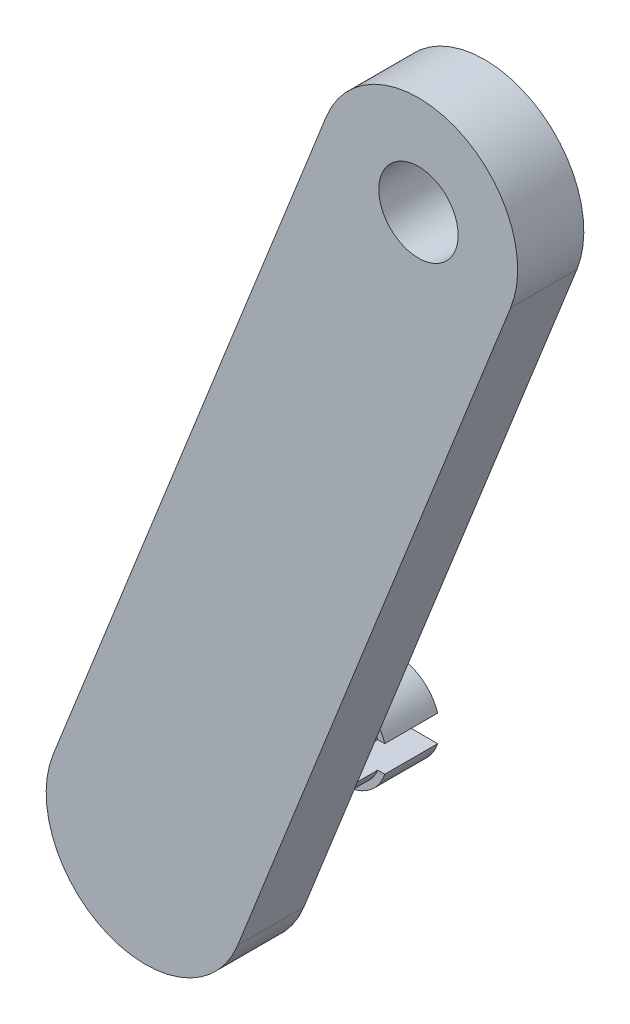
ISO-10303-21;
HEADER;
FILE_DESCRIPTION(('STEP AP214'),'2;1');
FILE_NAME('part.step','',(''),(''),'','','');
FILE_SCHEMA(('AUTOMOTIVE_DESIGN { 1 0 10303 214 1 1 1 1 }'));
ENDSEC;
DATA;
#1=APPLICATION_CONTEXT('core data for automotive mechanical design processes');
#2=APPLICATION_PROTOCOL_DEFINITION('international standard','automotive_design',2000,#1);
#3=PRODUCT_CONTEXT('',#1,'mechanical');
#4=PRODUCT('Part','Part','',(#3));
#5=PRODUCT_RELATED_PRODUCT_CATEGORY('part','',(#4));
#6=PRODUCT_DEFINITION_FORMATION('','',#4);
#7=PRODUCT_DEFINITION_CONTEXT('part definition',#1,'design');
#8=PRODUCT_DEFINITION('design','',#6,#7);
#9=PRODUCT_DEFINITION_SHAPE('','',#8);
#10=(LENGTH_UNIT() NAMED_UNIT(*) SI_UNIT(.MILLI.,.METRE.));
#11=(NAMED_UNIT(*) PLANE_ANGLE_UNIT() SI_UNIT($,.RADIAN.));
#12=(NAMED_UNIT(*) SI_UNIT($,.STERADIAN.) SOLID_ANGLE_UNIT());
#13=UNCERTAINTY_MEASURE_WITH_UNIT(LENGTH_MEASURE(1.E-05),#10,'distance_accuracy_value','');
#14=(GEOMETRIC_REPRESENTATION_CONTEXT(3) GLOBAL_UNCERTAINTY_ASSIGNED_CONTEXT((#13)) GLOBAL_UNIT_ASSIGNED_CONTEXT((#10,
#11,#12)) REPRESENTATION_CONTEXT('',''));
#15=CARTESIAN_POINT('',(0.,0.,0.));
#16=DIRECTION('',(0.,0.,1.));
#17=DIRECTION('',(1.,0.,0.));
#18=AXIS2_PLACEMENT_3D('',#15,#16,#17);
#19=CARTESIAN_POINT('',(-84.6394468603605,-56.057787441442,-10.));
#20=DIRECTION('',(0.,0.,1.));
#21=DIRECTION('',(1.,0.,0.));
#22=AXIS2_PLACEMENT_3D('',#19,#20,#21);
#23=CYLINDRICAL_SURFACE('',#22,2.75000000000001);
#24=DIRECTION('',(0.,0.,1.));
#25=VECTOR('',#24,1.);
#26=CARTESIAN_POINT('',(-87.2011845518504,-55.057787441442,-10.));
#27=LINE('',#26,#25);
#28=CARTESIAN_POINT('',(-87.2011845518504,-55.057787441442,0.));
#29=VERTEX_POINT('',#28);
#30=CARTESIAN_POINT('',(-87.2011845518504,-55.057787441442,-10.));
#31=VERTEX_POINT('',#30);
#32=EDGE_CURVE('E164',#29,#31,#27,.F.);
#33=ORIENTED_EDGE('',*,*,#32,.F.);
#34=CARTESIAN_POINT('',(-84.6394468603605,-56.057787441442,0.));
#35=DIRECTION('',(0.,0.,1.));
#36=DIRECTION('',(1.,0.,0.));
#37=AXIS2_PLACEMENT_3D('',#34,#35,#36);
#38=CIRCLE('',#37,2.75000000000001);
#39=CARTESIAN_POINT('',(-82.0777091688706,-55.057787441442,0.));
#40=VERTEX_POINT('',#39);
#41=EDGE_CURVE('E182',#40,#29,#38,.T.);
#42=ORIENTED_EDGE('',*,*,#41,.F.);
#43=DIRECTION('',(0.,0.,1.));
#44=VECTOR('',#43,1.);
#45=CARTESIAN_POINT('',(-82.0777091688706,-55.057787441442,-10.));
#46=LINE('',#45,#44);
#47=CARTESIAN_POINT('',(-82.0777091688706,-55.057787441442,-10.));
#48=VERTEX_POINT('',#47);
#49=EDGE_CURVE('E222',#48,#40,#46,.T.);
#50=ORIENTED_EDGE('',*,*,#49,.F.);
#51=CARTESIAN_POINT('',(-84.6394468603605,-56.057787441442,-10.));
#52=DIRECTION('',(0.,0.,1.));
#53=DIRECTION('',(1.,0.,0.));
#54=AXIS2_PLACEMENT_3D('',#51,#52,#53);
#55=CIRCLE('',#54,2.75000000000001);
#56=EDGE_CURVE('E167',#48,#31,#55,.T.);
#57=ORIENTED_EDGE('',*,*,#56,.T.);
#58=EDGE_LOOP('',(#33,#42,#50,#57));
#59=FACE_BOUND('',#58,.T.);
#60=ADVANCED_FACE('F37',(#59),#23,.T.);
#61=CARTESIAN_POINT('',(-84.6394468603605,-56.057787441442,-14.));
#62=DIRECTION('',(0.,0.,1.));
#63=DIRECTION('',(1.,0.,0.));
#64=AXIS2_PLACEMENT_3D('',#61,#62,#63);
#65=CYLINDRICAL_SURFACE('',#64,3.25000000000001);
#66=CARTESIAN_POINT('',(-84.6394468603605,-56.057787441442,-14.));
#67=DIRECTION('',(0.,0.,-1.));
#68=DIRECTION('',(-1.,0.,0.));
#69=AXIS2_PLACEMENT_3D('',#66,#67,#68);
#70=CIRCLE('',#69,3.25000000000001);
#71=CARTESIAN_POINT('',(-87.7317760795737,-55.057787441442,-14.));
#72=VERTEX_POINT('',#71);
#73=CARTESIAN_POINT('',(-81.5471176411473,-55.057787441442,-14.));
#74=VERTEX_POINT('',#73);
#75=EDGE_CURVE('E155',#72,#74,#70,.T.);
#76=ORIENTED_EDGE('',*,*,#75,.F.);
#77=DIRECTION('',(0.,0.,1.));
#78=VECTOR('',#77,1.);
#79=CARTESIAN_POINT('',(-87.7317760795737,-55.057787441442,-14.));
#80=LINE('',#79,#78);
#81=CARTESIAN_POINT('',(-87.7317760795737,-55.057787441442,-10.));
#82=VERTEX_POINT('',#81);
#83=EDGE_CURVE('E223',#72,#82,#80,.T.);
#84=ORIENTED_EDGE('',*,*,#83,.T.);
#85=CARTESIAN_POINT('',(-84.6394468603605,-56.057787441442,-10.));
#86=DIRECTION('',(0.,0.,-1.));
#87=DIRECTION('',(-1.,0.,0.));
#88=AXIS2_PLACEMENT_3D('',#85,#86,#87);
#89=CIRCLE('',#88,3.25000000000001);
#90=CARTESIAN_POINT('',(-81.5471176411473,-55.057787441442,-10.));
#91=VERTEX_POINT('',#90);
#92=EDGE_CURVE('E156',#82,#91,#89,.T.);
#93=ORIENTED_EDGE('',*,*,#92,.T.);
#94=DIRECTION('',(0.,0.,1.));
#95=VECTOR('',#94,1.);
#96=CARTESIAN_POINT('',(-81.5471176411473,-55.057787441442,-14.));
#97=LINE('',#96,#95);
#98=EDGE_CURVE('E219',#91,#74,#97,.F.);
#99=ORIENTED_EDGE('',*,*,#98,.T.);
#100=EDGE_LOOP('',(#76,#84,#93,#99));
#101=FACE_BOUND('',#100,.T.);
#102=ADVANCED_FACE('F244',(#101),#65,.T.);
#103=CARTESIAN_POINT('',(-84.6394468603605,-56.057787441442,-14.));
#104=DIRECTION('',(0.,0.,-1.));
#105=DIRECTION('',(-1.,0.,0.));
#106=AXIS2_PLACEMENT_3D('',#103,#104,#105);
#107=PLANE('',#106);
#108=DIRECTION('',(1.,0.,0.));
#109=VECTOR('',#108,1.);
#110=CARTESIAN_POINT('',(-79.6394468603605,-55.057787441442,-14.));
#111=LINE('',#110,#109);
#112=EDGE_CURVE('E152',#72,#74,#111,.T.);
#113=ORIENTED_EDGE('',*,*,#112,.F.);
#114=ORIENTED_EDGE('',*,*,#75,.T.);
#115=EDGE_LOOP('',(#113,#114));
#116=FACE_BOUND('',#115,.T.);
#117=ADVANCED_FACE('F245',(#116),#107,.T.);
#118=CARTESIAN_POINT('',(-84.6394468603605,-56.057787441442,-10.));
#119=DIRECTION('',(0.,0.,-1.));
#120=DIRECTION('',(-1.,0.,0.));
#121=AXIS2_PLACEMENT_3D('',#118,#119,#120);
#122=PLANE('',#121);
#123=ORIENTED_EDGE('',*,*,#92,.F.);
#124=DIRECTION('',(1.,0.,0.));
#125=VECTOR('',#124,1.);
#126=CARTESIAN_POINT('',(-84.6394468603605,-55.057787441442,-10.));
#127=LINE('',#126,#125);
#128=EDGE_CURVE('E11',#82,#31,#127,.T.);
#129=ORIENTED_EDGE('',*,*,#128,.T.);
#130=ORIENTED_EDGE('',*,*,#56,.F.);
#131=EDGE_CURVE('E46',#48,#91,#127,.T.);
#132=ORIENTED_EDGE('',*,*,#131,.T.);
#133=EDGE_LOOP('',(#123,#129,#130,#132));
#134=FACE_BOUND('',#133,.T.);
#135=ADVANCED_FACE('F233',(#134),#122,.F.);
#136=CARTESIAN_POINT('',(-64.,-4.,5.));
#137=DIRECTION('',(0.,0.,-1.));
#138=DIRECTION('',(-1.,0.,0.));
#139=AXIS2_PLACEMENT_3D('',#136,#137,#138);
#140=CYLINDRICAL_SURFACE('',#139,7.5);
#141=CARTESIAN_POINT('',(-64.,-4.,0.));
#142=DIRECTION('',(0.,0.,1.));
#143=DIRECTION('',(1.,0.,0.));
#144=AXIS2_PLACEMENT_3D('',#141,#142,#143);
#145=CIRCLE('',#144,7.5);
#146=CARTESIAN_POINT('',(-57.0279748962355,-6.76421163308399,0.));
#147=VERTEX_POINT('',#146);
#148=CARTESIAN_POINT('',(-70.9720251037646,-1.235788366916,0.));
#149=VERTEX_POINT('',#148);
#150=EDGE_CURVE('E178',#147,#149,#145,.T.);
#151=ORIENTED_EDGE('',*,*,#150,.T.);
#152=DIRECTION('',(0.,0.,-1.));
#153=VECTOR('',#152,1.);
#154=CARTESIAN_POINT('',(-70.9720251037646,-1.235788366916,5.));
#155=LINE('',#154,#153);
#156=CARTESIAN_POINT('',(-70.9720251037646,-1.235788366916,5.));
#157=VERTEX_POINT('',#156);
#158=EDGE_CURVE('E193',#157,#149,#155,.T.);
#159=ORIENTED_EDGE('',*,*,#158,.F.);
#160=CARTESIAN_POINT('',(-64.,-4.,5.));
#161=DIRECTION('',(0.,0.,1.));
#162=DIRECTION('',(1.,0.,0.));
#163=AXIS2_PLACEMENT_3D('',#160,#161,#162);
#164=CIRCLE('',#163,7.5);
#165=CARTESIAN_POINT('',(-57.0279748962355,-6.76421163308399,5.));
#166=VERTEX_POINT('',#165);
#167=EDGE_CURVE('E171',#166,#157,#164,.T.);
#168=ORIENTED_EDGE('',*,*,#167,.F.);
#169=DIRECTION('',(0.,0.,-1.));
#170=VECTOR('',#169,1.);
#171=CARTESIAN_POINT('',(-57.0279748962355,-6.76421163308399,5.));
#172=LINE('',#171,#170);
#173=EDGE_CURVE('E177',#166,#147,#172,.T.);
#174=ORIENTED_EDGE('',*,*,#173,.T.);
#175=EDGE_LOOP('',(#151,#159,#168,#174));
#176=FACE_BOUND('',#175,.T.);
#177=ADVANCED_FACE('F39',(#176),#140,.T.);
#178=CARTESIAN_POINT('',(-70.9720251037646,-1.235788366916,5.));
#179=DIRECTION('',(0.929603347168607,-0.368561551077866,0.));
#180=DIRECTION('',(0.368561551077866,0.929603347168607,0.));
#181=AXIS2_PLACEMENT_3D('',#178,#179,#180);
#182=PLANE('',#181);
#183=DIRECTION('',(-0.368561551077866,-0.929603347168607,0.));
#184=VECTOR('',#183,1.);
#185=CARTESIAN_POINT('',(-70.9720251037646,-1.235788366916,0.));
#186=LINE('',#185,#184);
#187=CARTESIAN_POINT('',(-91.6114719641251,-53.293575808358,0.));
#188=VERTEX_POINT('',#187);
#189=EDGE_CURVE('E181',#149,#188,#186,.T.);
#190=ORIENTED_EDGE('',*,*,#189,.T.);
#191=DIRECTION('',(0.,0.,-1.));
#192=VECTOR('',#191,1.);
#193=CARTESIAN_POINT('',(-91.6114719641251,-53.293575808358,5.));
#194=LINE('',#193,#192);
#195=CARTESIAN_POINT('',(-91.6114719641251,-53.293575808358,5.));
#196=VERTEX_POINT('',#195);
#197=EDGE_CURVE('E190',#196,#188,#194,.T.);
#198=ORIENTED_EDGE('',*,*,#197,.F.);
#199=DIRECTION('',(-0.368561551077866,-0.929603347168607,0.));
#200=VECTOR('',#199,1.);
#201=CARTESIAN_POINT('',(-70.9720251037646,-1.235788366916,5.));
#202=LINE('',#201,#200);
#203=EDGE_CURVE('E91',#157,#196,#202,.T.);
#204=ORIENTED_EDGE('',*,*,#203,.F.);
#205=ORIENTED_EDGE('',*,*,#158,.T.);
#206=EDGE_LOOP('',(#190,#198,#204,#205));
#207=FACE_BOUND('',#206,.T.);
#208=ADVANCED_FACE('F280',(#207),#182,.F.);
#209=CARTESIAN_POINT('',(-84.6394468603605,-56.057787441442,5.));
#210=DIRECTION('',(0.,0.,-1.));
#211=DIRECTION('',(-1.,0.,0.));
#212=AXIS2_PLACEMENT_3D('',#209,#210,#211);
#213=CYLINDRICAL_SURFACE('',#212,7.50000000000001);
#214=CARTESIAN_POINT('',(-84.6394468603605,-56.057787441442,0.));
#215=DIRECTION('',(0.,0.,1.));
#216=DIRECTION('',(1.,0.,0.));
#217=AXIS2_PLACEMENT_3D('',#214,#215,#216);
#218=CIRCLE('',#217,7.50000000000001);
#219=CARTESIAN_POINT('',(-77.667421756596,-58.821999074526,0.));
#220=VERTEX_POINT('',#219);
#221=EDGE_CURVE('E184',#188,#220,#218,.T.);
#222=ORIENTED_EDGE('',*,*,#221,.T.);
#223=DIRECTION('',(0.,0.,-1.));
#224=VECTOR('',#223,1.);
#225=CARTESIAN_POINT('',(-77.667421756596,-58.821999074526,5.));
#226=LINE('',#225,#224);
#227=CARTESIAN_POINT('',(-77.667421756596,-58.821999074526,5.));
#228=VERTEX_POINT('',#227);
#229=EDGE_CURVE('E188',#228,#220,#226,.T.);
#230=ORIENTED_EDGE('',*,*,#229,.F.);
#231=CARTESIAN_POINT('',(-84.6394468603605,-56.057787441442,5.));
#232=DIRECTION('',(0.,0.,1.));
#233=DIRECTION('',(1.,0.,0.));
#234=AXIS2_PLACEMENT_3D('',#231,#232,#233);
#235=CIRCLE('',#234,7.50000000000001);
#236=EDGE_CURVE('E174',#196,#228,#235,.T.);
#237=ORIENTED_EDGE('',*,*,#236,.F.);
#238=ORIENTED_EDGE('',*,*,#197,.T.);
#239=EDGE_LOOP('',(#222,#230,#237,#238));
#240=FACE_BOUND('',#239,.T.);
#241=ADVANCED_FACE('F278',(#240),#213,.T.);
#242=CARTESIAN_POINT('',(-57.0279748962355,-6.76421163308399,5.));
#243=DIRECTION('',(-0.929603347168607,0.368561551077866,0.));
#244=DIRECTION('',(-0.368561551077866,-0.929603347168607,0.));
#245=AXIS2_PLACEMENT_3D('',#242,#243,#244);
#246=PLANE('',#245);
#247=DIRECTION('',(0.368561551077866,0.929603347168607,0.));
#248=VECTOR('',#247,1.);
#249=CARTESIAN_POINT('',(-57.0279748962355,-6.76421163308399,0.));
#250=LINE('',#249,#248);
#251=EDGE_CURVE('E83',#220,#147,#250,.T.);
#252=ORIENTED_EDGE('',*,*,#251,.T.);
#253=ORIENTED_EDGE('',*,*,#173,.F.);
#254=DIRECTION('',(0.368561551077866,0.929603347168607,0.));
#255=VECTOR('',#254,1.);
#256=CARTESIAN_POINT('',(-57.0279748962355,-6.76421163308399,5.));
#257=LINE('',#256,#255);
#258=EDGE_CURVE('E62',#228,#166,#257,.T.);
#259=ORIENTED_EDGE('',*,*,#258,.F.);
#260=ORIENTED_EDGE('',*,*,#229,.T.);
#261=EDGE_LOOP('',(#252,#253,#259,#260));
#262=FACE_BOUND('',#261,.T.);
#263=ADVANCED_FACE('F272',(#262),#246,.F.);
#264=CARTESIAN_POINT('',(-64.,-4.,5.));
#265=DIRECTION('',(0.,0.,1.));
#266=DIRECTION('',(1.,0.,0.));
#267=AXIS2_PLACEMENT_3D('',#264,#265,#266);
#268=PLANE('',#267);
#269=CARTESIAN_POINT('',(-64.,-4.,5.));
#270=DIRECTION('',(0.,0.,1.));
#271=DIRECTION('',(1.,0.,0.));
#272=AXIS2_PLACEMENT_3D('',#269,#270,#271);
#273=CIRCLE('',#272,3.);
#274=CARTESIAN_POINT('',(-61.,-4.,5.));
#275=VERTEX_POINT('',#274);
#276=EDGE_CURVE('E434',#275,#275,#273,.T.);
#277=ORIENTED_EDGE('',*,*,#276,.F.);
#278=EDGE_LOOP('',(#277));
#279=FACE_BOUND('',#278,.T.);
#280=ORIENTED_EDGE('',*,*,#167,.T.);
#281=ORIENTED_EDGE('',*,*,#203,.T.);
#282=ORIENTED_EDGE('',*,*,#236,.T.);
#283=ORIENTED_EDGE('',*,*,#258,.T.);
#284=EDGE_LOOP('',(#280,#281,#282,#283));
#285=FACE_BOUND('',#284,.T.);
#286=ADVANCED_FACE('F266',(#279,#285),#268,.T.);
#287=CARTESIAN_POINT('',(-64.,-4.,0.));
#288=DIRECTION('',(0.,0.,1.));
#289=DIRECTION('',(1.,0.,0.));
#290=AXIS2_PLACEMENT_3D('',#287,#288,#289);
#291=PLANE('',#290);
#292=CARTESIAN_POINT('',(-64.,-4.,0.));
#293=DIRECTION('',(0.,0.,1.));
#294=DIRECTION('',(1.,0.,0.));
#295=AXIS2_PLACEMENT_3D('',#292,#293,#294);
#296=CIRCLE('',#295,3.);
#297=CARTESIAN_POINT('',(-61.,-4.,0.));
#298=VERTEX_POINT('',#297);
#299=EDGE_CURVE('E41',#298,#298,#296,.T.);
#300=ORIENTED_EDGE('',*,*,#299,.T.);
#301=EDGE_LOOP('',(#300));
#302=FACE_BOUND('',#301,.T.);
#303=DIRECTION('',(1.,0.,0.));
#304=VECTOR('',#303,1.);
#305=CARTESIAN_POINT('',(-79.6394468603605,-55.057787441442,0.));
#306=LINE('',#305,#304);
#307=EDGE_CURVE('E214',#29,#40,#306,.T.);
#308=ORIENTED_EDGE('',*,*,#307,.T.);
#309=ORIENTED_EDGE('',*,*,#41,.T.);
#310=EDGE_LOOP('',(#308,#309));
#311=FACE_BOUND('',#310,.T.);
#312=DIRECTION('',(-1.,0.,0.));
#313=VECTOR('',#312,1.);
#314=CARTESIAN_POINT('',(-79.6394468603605,-57.057787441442,0.));
#315=LINE('',#314,#313);
#316=CARTESIAN_POINT('',(-82.0777091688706,-57.057787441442,0.));
#317=VERTEX_POINT('',#316);
#318=CARTESIAN_POINT('',(-87.2011845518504,-57.057787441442,0.));
#319=VERTEX_POINT('',#318);
#320=EDGE_CURVE('E238',#317,#319,#315,.T.);
#321=ORIENTED_EDGE('',*,*,#320,.T.);
#322=EDGE_CURVE('E170',#319,#317,#38,.T.);
#323=ORIENTED_EDGE('',*,*,#322,.T.);
#324=EDGE_LOOP('',(#321,#323));
#325=FACE_BOUND('',#324,.T.);
#326=ORIENTED_EDGE('',*,*,#150,.F.);
#327=ORIENTED_EDGE('',*,*,#251,.F.);
#328=ORIENTED_EDGE('',*,*,#221,.F.);
#329=ORIENTED_EDGE('',*,*,#189,.F.);
#330=EDGE_LOOP('',(#326,#327,#328,#329));
#331=FACE_BOUND('',#330,.T.);
#332=ADVANCED_FACE('F236',(#302,#311,#325,#331),#291,.F.);
#333=DIRECTION('',(0.,0.,1.));
#334=VECTOR('',#333,1.);
#335=CARTESIAN_POINT('',(-82.0777091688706,-57.057787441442,-10.));
#336=LINE('',#335,#334);
#337=CARTESIAN_POINT('',(-82.0777091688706,-57.057787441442,-10.));
#338=VERTEX_POINT('',#337);
#339=EDGE_CURVE('E145',#317,#338,#336,.F.);
#340=ORIENTED_EDGE('',*,*,#339,.F.);
#341=ORIENTED_EDGE('',*,*,#322,.F.);
#342=DIRECTION('',(0.,0.,1.));
#343=VECTOR('',#342,1.);
#344=CARTESIAN_POINT('',(-87.2011845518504,-57.057787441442,-10.));
#345=LINE('',#344,#343);
#346=CARTESIAN_POINT('',(-87.2011845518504,-57.057787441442,-10.));
#347=VERTEX_POINT('',#346);
#348=EDGE_CURVE('E146',#347,#319,#345,.T.);
#349=ORIENTED_EDGE('',*,*,#348,.F.);
#350=EDGE_CURVE('E159',#347,#338,#55,.T.);
#351=ORIENTED_EDGE('',*,*,#350,.T.);
#352=EDGE_LOOP('',(#340,#341,#349,#351));
#353=FACE_BOUND('',#352,.T.);
#354=ADVANCED_FACE('F209',(#353),#23,.T.);
#355=CARTESIAN_POINT('',(-81.5471176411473,-57.057787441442,-14.));
#356=VERTEX_POINT('',#355);
#357=CARTESIAN_POINT('',(-87.7317760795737,-57.057787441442,-14.));
#358=VERTEX_POINT('',#357);
#359=EDGE_CURVE('E151',#356,#358,#70,.T.);
#360=ORIENTED_EDGE('',*,*,#359,.F.);
#361=DIRECTION('',(0.,0.,1.));
#362=VECTOR('',#361,1.);
#363=CARTESIAN_POINT('',(-81.5471176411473,-57.057787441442,-14.));
#364=LINE('',#363,#362);
#365=CARTESIAN_POINT('',(-81.5471176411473,-57.057787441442,-10.));
#366=VERTEX_POINT('',#365);
#367=EDGE_CURVE('E135',#356,#366,#364,.T.);
#368=ORIENTED_EDGE('',*,*,#367,.T.);
#369=CARTESIAN_POINT('',(-87.7317760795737,-57.057787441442,-10.));
#370=VERTEX_POINT('',#369);
#371=EDGE_CURVE('E161',#366,#370,#89,.T.);
#372=ORIENTED_EDGE('',*,*,#371,.T.);
#373=DIRECTION('',(0.,0.,1.));
#374=VECTOR('',#373,1.);
#375=CARTESIAN_POINT('',(-87.7317760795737,-57.057787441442,-14.));
#376=LINE('',#375,#374);
#377=EDGE_CURVE('E53',#370,#358,#376,.F.);
#378=ORIENTED_EDGE('',*,*,#377,.T.);
#379=EDGE_LOOP('',(#360,#368,#372,#378));
#380=FACE_BOUND('',#379,.T.);
#381=ADVANCED_FACE('F154',(#380),#65,.T.);
#382=DIRECTION('',(-1.,0.,0.));
#383=VECTOR('',#382,1.);
#384=CARTESIAN_POINT('',(-79.6394468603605,-57.057787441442,-14.));
#385=LINE('',#384,#383);
#386=EDGE_CURVE('E138',#356,#358,#385,.T.);
#387=ORIENTED_EDGE('',*,*,#386,.F.);
#388=ORIENTED_EDGE('',*,*,#359,.T.);
#389=EDGE_LOOP('',(#387,#388));
#390=FACE_BOUND('',#389,.T.);
#391=ADVANCED_FACE('F150',(#390),#107,.T.);
#392=ORIENTED_EDGE('',*,*,#371,.F.);
#393=DIRECTION('',(-1.,0.,0.));
#394=VECTOR('',#393,1.);
#395=CARTESIAN_POINT('',(-84.6394468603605,-57.057787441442,-10.));
#396=LINE('',#395,#394);
#397=EDGE_CURVE('E140',#366,#338,#396,.T.);
#398=ORIENTED_EDGE('',*,*,#397,.T.);
#399=ORIENTED_EDGE('',*,*,#350,.F.);
#400=EDGE_CURVE('E195',#347,#370,#396,.T.);
#401=ORIENTED_EDGE('',*,*,#400,.T.);
#402=EDGE_LOOP('',(#392,#398,#399,#401));
#403=FACE_BOUND('',#402,.T.);
#404=ADVANCED_FACE('F205',(#403),#122,.F.);
#405=CARTESIAN_POINT('',(-79.6394468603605,-55.057787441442,0.));
#406=DIRECTION('',(0.,1.,0.));
#407=DIRECTION('',(0.,0.,1.));
#408=AXIS2_PLACEMENT_3D('',#405,#406,#407);
#409=PLANE('',#408);
#410=ORIENTED_EDGE('',*,*,#32,.T.);
#411=ORIENTED_EDGE('',*,*,#128,.F.);
#412=ORIENTED_EDGE('',*,*,#83,.F.);
#413=ORIENTED_EDGE('',*,*,#112,.T.);
#414=ORIENTED_EDGE('',*,*,#98,.F.);
#415=ORIENTED_EDGE('',*,*,#131,.F.);
#416=ORIENTED_EDGE('',*,*,#49,.T.);
#417=ORIENTED_EDGE('',*,*,#307,.F.);
#418=EDGE_LOOP('',(#410,#411,#412,#413,#414,#415,#416,#417));
#419=FACE_BOUND('',#418,.T.);
#420=ADVANCED_FACE('F229',(#419),#409,.F.);
#421=CARTESIAN_POINT('',(-79.6394468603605,-57.057787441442,0.));
#422=DIRECTION('',(0.,-1.,0.));
#423=DIRECTION('',(0.,0.,-1.));
#424=AXIS2_PLACEMENT_3D('',#421,#422,#423);
#425=PLANE('',#424);
#426=ORIENTED_EDGE('',*,*,#339,.T.);
#427=ORIENTED_EDGE('',*,*,#397,.F.);
#428=ORIENTED_EDGE('',*,*,#367,.F.);
#429=ORIENTED_EDGE('',*,*,#386,.T.);
#430=ORIENTED_EDGE('',*,*,#377,.F.);
#431=ORIENTED_EDGE('',*,*,#400,.F.);
#432=ORIENTED_EDGE('',*,*,#348,.T.);
#433=ORIENTED_EDGE('',*,*,#320,.F.);
#434=EDGE_LOOP('',(#426,#427,#428,#429,#430,#431,#432,#433));
#435=FACE_BOUND('',#434,.T.);
#436=ADVANCED_FACE('F137',(#435),#425,.F.);
#437=CARTESIAN_POINT('',(-64.,-4.,-9.));
#438=DIRECTION('',(0.,0.,1.));
#439=DIRECTION('',(1.,0.,0.));
#440=AXIS2_PLACEMENT_3D('',#437,#438,#439);
#441=CYLINDRICAL_SURFACE('',#440,3.);
#442=ORIENTED_EDGE('',*,*,#276,.T.);
#443=EDGE_LOOP('',(#442));
#444=FACE_BOUND('',#443,.T.);
#445=ORIENTED_EDGE('',*,*,#299,.F.);
#446=EDGE_LOOP('',(#445));
#447=FACE_BOUND('',#446,.T.);
#448=ADVANCED_FACE('F350',(#444,#447),#441,.F.);
#449=CLOSED_SHELL('',(#60,#102,#117,#135,#177,#208,#241,#263,#286,#332,#354,#381,#391,#404,#420,
#436,#448));
#450=MANIFOLD_SOLID_BREP('B2',#449);
#451=ADVANCED_BREP_SHAPE_REPRESENTATION('',(#18,#450),#14);
#452=SHAPE_DEFINITION_REPRESENTATION(#9,#451);
ENDSEC;
END-ISO-10303-21;
